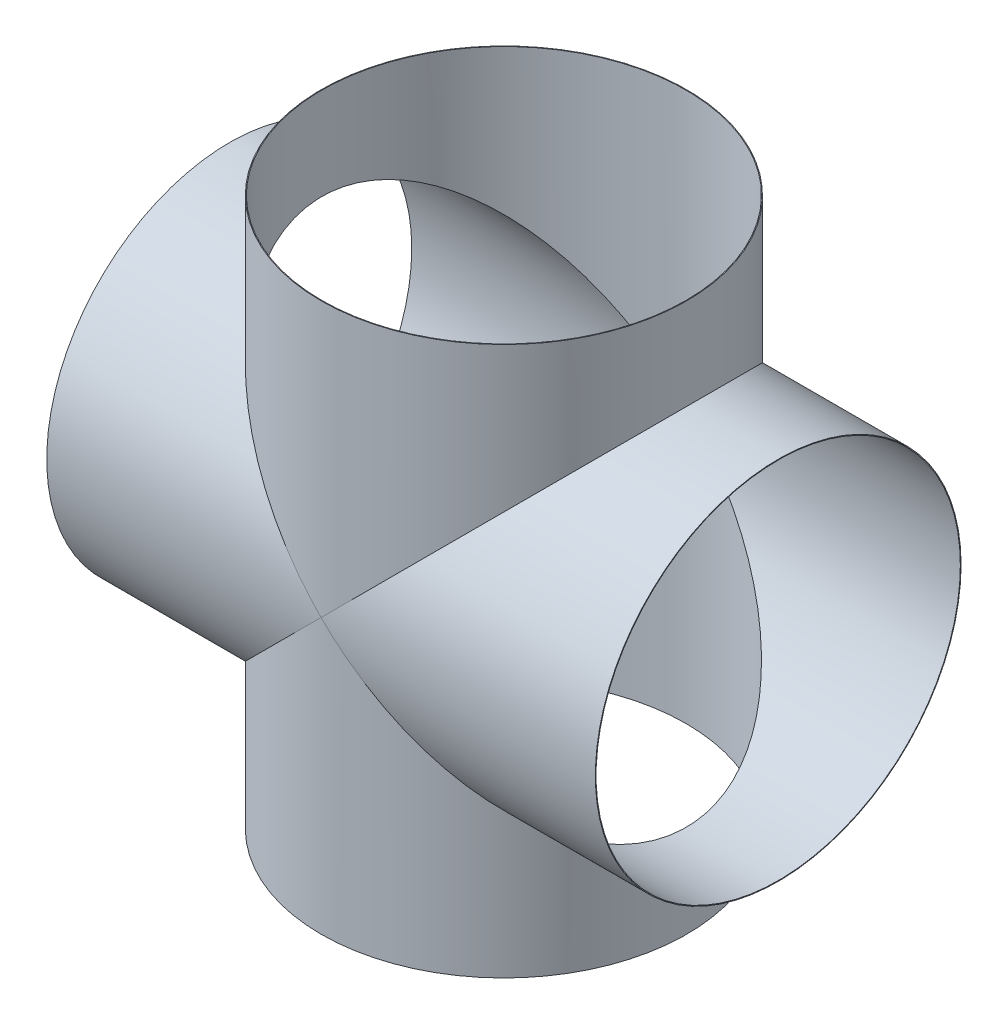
ISO-10303-21;
HEADER;
FILE_DESCRIPTION(('STEP AP214'),'2;1');
FILE_NAME('part.step','',(''),(''),'','','');
FILE_SCHEMA(('AUTOMOTIVE_DESIGN { 1 0 10303 214 1 1 1 1 }'));
ENDSEC;
DATA;
#1=APPLICATION_CONTEXT('core data for automotive mechanical design processes');
#2=APPLICATION_PROTOCOL_DEFINITION('international standard','automotive_design',2000,#1);
#3=PRODUCT_CONTEXT('',#1,'mechanical');
#4=PRODUCT('Part','Part','',(#3));
#5=PRODUCT_RELATED_PRODUCT_CATEGORY('part','',(#4));
#6=PRODUCT_DEFINITION_FORMATION('','',#4);
#7=PRODUCT_DEFINITION_CONTEXT('part definition',#1,'design');
#8=PRODUCT_DEFINITION('design','',#6,#7);
#9=PRODUCT_DEFINITION_SHAPE('','',#8);
#10=(LENGTH_UNIT() NAMED_UNIT(*) SI_UNIT(.MILLI.,.METRE.));
#11=(NAMED_UNIT(*) PLANE_ANGLE_UNIT() SI_UNIT($,.RADIAN.));
#12=(NAMED_UNIT(*) SI_UNIT($,.STERADIAN.) SOLID_ANGLE_UNIT());
#13=UNCERTAINTY_MEASURE_WITH_UNIT(LENGTH_MEASURE(1.E-05),#10,'distance_accuracy_value','');
#14=(GEOMETRIC_REPRESENTATION_CONTEXT(3) GLOBAL_UNCERTAINTY_ASSIGNED_CONTEXT((#13)) GLOBAL_UNIT_ASSIGNED_CONTEXT((#10,
#11,#12)) REPRESENTATION_CONTEXT('',''));
#15=CARTESIAN_POINT('',(0.,0.,0.));
#16=DIRECTION('',(0.,0.,1.));
#17=DIRECTION('',(1.,0.,0.));
#18=AXIS2_PLACEMENT_3D('',#15,#16,#17);
#19=CARTESIAN_POINT('',(750.,0.,0.));
#20=DIRECTION('',(-1.,0.,0.));
#21=DIRECTION('',(0.,0.,1.));
#22=AXIS2_PLACEMENT_3D('',#19,#20,#21);
#23=CYLINDRICAL_SURFACE('',#22,498.);
#24=CARTESIAN_POINT('',(750.,0.,0.));
#25=DIRECTION('',(1.,0.,0.));
#26=DIRECTION('',(0.,0.,-1.));
#27=AXIS2_PLACEMENT_3D('',#24,#25,#26);
#28=CIRCLE('',#27,498.);
#29=CARTESIAN_POINT('',(750.,0.,-498.));
#30=VERTEX_POINT('',#29);
#31=EDGE_CURVE('E112',#30,#30,#28,.T.);
#32=ORIENTED_EDGE('',*,*,#31,.T.);
#33=EDGE_LOOP('',(#32));
#34=FACE_BOUND('',#33,.T.);
#35=CARTESIAN_POINT('',(0.,0.,0.));
#36=DIRECTION('',(-0.707106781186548,0.707106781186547,0.));
#37=DIRECTION('',(0.707106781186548,0.707106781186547,0.));
#38=AXIS2_PLACEMENT_3D('',#35,#36,#37);
#39=ELLIPSE('',#38,704.278354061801,498.);
#40=CARTESIAN_POINT('',(-1.11022302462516E-13,-1.11022302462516E-13,498.));
#41=VERTEX_POINT('',#40);
#42=CARTESIAN_POINT('',(0.,0.,-498.));
#43=VERTEX_POINT('',#42);
#44=EDGE_CURVE('E85',#41,#43,#39,.T.);
#45=ORIENTED_EDGE('',*,*,#44,.T.);
#46=CARTESIAN_POINT('',(0.,0.,0.));
#47=DIRECTION('',(-0.707106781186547,-0.707106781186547,0.));
#48=DIRECTION('',(0.707106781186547,-0.707106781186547,0.));
#49=AXIS2_PLACEMENT_3D('',#46,#47,#48);
#50=ELLIPSE('',#49,704.278354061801,498.);
#51=EDGE_CURVE('E71',#41,#43,#50,.F.);
#52=ORIENTED_EDGE('',*,*,#51,.F.);
#53=EDGE_LOOP('',(#45,#52));
#54=FACE_BOUND('',#53,.T.);
#55=ADVANCED_FACE('F50',(#34,#54),#23,.F.);
#56=CARTESIAN_POINT('',(-750.,0.,0.));
#57=DIRECTION('',(1.,0.,0.));
#58=DIRECTION('',(0.,0.,-1.));
#59=AXIS2_PLACEMENT_3D('',#56,#57,#58);
#60=CIRCLE('',#59,498.);
#61=CARTESIAN_POINT('',(-750.,0.,-498.));
#62=VERTEX_POINT('',#61);
#63=EDGE_CURVE('E103',#62,#62,#60,.T.);
#64=ORIENTED_EDGE('',*,*,#63,.F.);
#65=EDGE_LOOP('',(#64));
#66=FACE_BOUND('',#65,.T.);
#67=CARTESIAN_POINT('',(0.,0.,0.));
#68=DIRECTION('',(0.707106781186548,0.707106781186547,0.));
#69=DIRECTION('',(-0.707106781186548,0.707106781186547,0.));
#70=AXIS2_PLACEMENT_3D('',#67,#68,#69);
#71=ELLIPSE('',#70,704.278354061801,498.);
#72=EDGE_CURVE('E90',#43,#41,#71,.T.);
#73=ORIENTED_EDGE('',*,*,#72,.T.);
#74=CARTESIAN_POINT('',(0.,0.,0.));
#75=DIRECTION('',(0.707106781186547,-0.707106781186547,0.));
#76=DIRECTION('',(-0.707106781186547,-0.707106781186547,0.));
#77=AXIS2_PLACEMENT_3D('',#74,#75,#76);
#78=ELLIPSE('',#77,704.278354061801,498.);
#79=EDGE_CURVE('E76',#43,#41,#78,.F.);
#80=ORIENTED_EDGE('',*,*,#79,.F.);
#81=EDGE_LOOP('',(#73,#80));
#82=FACE_BOUND('',#81,.T.);
#83=ADVANCED_FACE('F93',(#66,#82),#23,.F.);
#84=CARTESIAN_POINT('',(750.,0.,0.));
#85=DIRECTION('',(-1.,0.,0.));
#86=DIRECTION('',(0.,0.,1.));
#87=AXIS2_PLACEMENT_3D('',#84,#85,#86);
#88=CYLINDRICAL_SURFACE('',#87,500.);
#89=CARTESIAN_POINT('',(750.,0.,0.));
#90=DIRECTION('',(1.,0.,0.));
#91=DIRECTION('',(0.,0.,-1.));
#92=AXIS2_PLACEMENT_3D('',#89,#90,#91);
#93=CIRCLE('',#92,500.);
#94=CARTESIAN_POINT('',(750.,0.,-500.));
#95=VERTEX_POINT('',#94);
#96=EDGE_CURVE('E12',#95,#95,#93,.T.);
#97=ORIENTED_EDGE('',*,*,#96,.F.);
#98=EDGE_LOOP('',(#97));
#99=FACE_BOUND('',#98,.T.);
#100=CARTESIAN_POINT('',(0.,0.,0.));
#101=DIRECTION('',(-0.707106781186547,-0.707106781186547,0.));
#102=DIRECTION('',(0.707106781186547,-0.707106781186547,0.));
#103=AXIS2_PLACEMENT_3D('',#100,#101,#102);
#104=ELLIPSE('',#103,707.106781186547,500.);
#105=CARTESIAN_POINT('',(0.,0.,500.));
#106=VERTEX_POINT('',#105);
#107=CARTESIAN_POINT('',(0.,0.,-500.));
#108=VERTEX_POINT('',#107);
#109=EDGE_CURVE('E95',#106,#108,#104,.F.);
#110=ORIENTED_EDGE('',*,*,#109,.T.);
#111=CARTESIAN_POINT('',(0.,0.,0.));
#112=DIRECTION('',(-0.707106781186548,0.707106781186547,0.));
#113=DIRECTION('',(0.707106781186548,0.707106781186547,0.));
#114=AXIS2_PLACEMENT_3D('',#111,#112,#113);
#115=ELLIPSE('',#114,707.106781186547,500.);
#116=EDGE_CURVE('E104',#106,#108,#115,.T.);
#117=ORIENTED_EDGE('',*,*,#116,.F.);
#118=EDGE_LOOP('',(#110,#117));
#119=FACE_BOUND('',#118,.T.);
#120=ADVANCED_FACE('F52',(#99,#119),#88,.T.);
#121=CARTESIAN_POINT('',(-750.,0.,0.));
#122=DIRECTION('',(1.,0.,0.));
#123=DIRECTION('',(0.,0.,-1.));
#124=AXIS2_PLACEMENT_3D('',#121,#122,#123);
#125=CIRCLE('',#124,500.);
#126=CARTESIAN_POINT('',(-750.,0.,-500.));
#127=VERTEX_POINT('',#126);
#128=EDGE_CURVE('E54',#127,#127,#125,.T.);
#129=ORIENTED_EDGE('',*,*,#128,.T.);
#130=EDGE_LOOP('',(#129));
#131=FACE_BOUND('',#130,.T.);
#132=CARTESIAN_POINT('',(0.,0.,0.));
#133=DIRECTION('',(0.707106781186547,-0.707106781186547,0.));
#134=DIRECTION('',(-0.707106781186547,-0.707106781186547,0.));
#135=AXIS2_PLACEMENT_3D('',#132,#133,#134);
#136=ELLIPSE('',#135,707.106781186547,500.);
#137=EDGE_CURVE('E64',#108,#106,#136,.F.);
#138=ORIENTED_EDGE('',*,*,#137,.T.);
#139=CARTESIAN_POINT('',(0.,0.,0.));
#140=DIRECTION('',(0.707106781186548,0.707106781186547,0.));
#141=DIRECTION('',(-0.707106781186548,0.707106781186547,0.));
#142=AXIS2_PLACEMENT_3D('',#139,#140,#141);
#143=ELLIPSE('',#142,707.106781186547,500.);
#144=EDGE_CURVE('E101',#108,#106,#143,.T.);
#145=ORIENTED_EDGE('',*,*,#144,.F.);
#146=EDGE_LOOP('',(#138,#145));
#147=FACE_BOUND('',#146,.T.);
#148=ADVANCED_FACE('F126',(#131,#147),#88,.T.);
#149=CARTESIAN_POINT('',(750.,0.,0.));
#150=DIRECTION('',(1.,0.,0.));
#151=DIRECTION('',(0.,0.,-1.));
#152=AXIS2_PLACEMENT_3D('',#149,#150,#151);
#153=PLANE('',#152);
#154=ORIENTED_EDGE('',*,*,#96,.T.);
#155=EDGE_LOOP('',(#154));
#156=FACE_BOUND('',#155,.T.);
#157=ORIENTED_EDGE('',*,*,#31,.F.);
#158=EDGE_LOOP('',(#157));
#159=FACE_BOUND('',#158,.T.);
#160=ADVANCED_FACE('F133',(#156,#159),#153,.T.);
#161=CARTESIAN_POINT('',(-750.,0.,0.));
#162=DIRECTION('',(1.,0.,0.));
#163=DIRECTION('',(0.,0.,-1.));
#164=AXIS2_PLACEMENT_3D('',#161,#162,#163);
#165=PLANE('',#164);
#166=ORIENTED_EDGE('',*,*,#128,.F.);
#167=EDGE_LOOP('',(#166));
#168=FACE_BOUND('',#167,.T.);
#169=ORIENTED_EDGE('',*,*,#63,.T.);
#170=EDGE_LOOP('',(#169));
#171=FACE_BOUND('',#170,.T.);
#172=ADVANCED_FACE('F118',(#168,#171),#165,.F.);
#173=CARTESIAN_POINT('',(0.,-500.001,0.));
#174=DIRECTION('',(0.,1.,0.));
#175=DIRECTION('',(0.,0.,1.));
#176=AXIS2_PLACEMENT_3D('',#173,#174,#175);
#177=CYLINDRICAL_SURFACE('',#176,500.);
#178=CARTESIAN_POINT('',(0.,750.,0.));
#179=DIRECTION('',(0.,1.,0.));
#180=DIRECTION('',(0.,0.,1.));
#181=AXIS2_PLACEMENT_3D('',#178,#179,#180);
#182=CIRCLE('',#181,500.);
#183=CARTESIAN_POINT('',(0.,750.,500.));
#184=VERTEX_POINT('',#183);
#185=EDGE_CURVE('E107',#184,#184,#182,.T.);
#186=ORIENTED_EDGE('',*,*,#185,.F.);
#187=EDGE_LOOP('',(#186));
#188=FACE_BOUND('',#187,.T.);
#189=ORIENTED_EDGE('',*,*,#144,.T.);
#190=ORIENTED_EDGE('',*,*,#116,.T.);
#191=EDGE_LOOP('',(#189,#190));
#192=FACE_BOUND('',#191,.T.);
#193=ADVANCED_FACE('F131',(#188,#192),#177,.T.);
#194=CARTESIAN_POINT('',(0.,750.,0.));
#195=DIRECTION('',(0.,1.,0.));
#196=DIRECTION('',(0.,0.,1.));
#197=AXIS2_PLACEMENT_3D('',#194,#195,#196);
#198=PLANE('',#197);
#199=CARTESIAN_POINT('',(0.,750.,0.));
#200=DIRECTION('',(0.,1.,0.));
#201=DIRECTION('',(1.,0.,0.));
#202=AXIS2_PLACEMENT_3D('',#199,#200,#201);
#203=CIRCLE('',#202,498.);
#204=CARTESIAN_POINT('',(498.,750.,0.));
#205=VERTEX_POINT('',#204);
#206=EDGE_CURVE('E91',#205,#205,#203,.T.);
#207=ORIENTED_EDGE('',*,*,#206,.F.);
#208=EDGE_LOOP('',(#207));
#209=FACE_BOUND('',#208,.T.);
#210=ORIENTED_EDGE('',*,*,#185,.T.);
#211=EDGE_LOOP('',(#210));
#212=FACE_BOUND('',#211,.T.);
#213=ADVANCED_FACE('F141',(#209,#212),#198,.T.);
#214=CARTESIAN_POINT('',(0.,-500.001,0.));
#215=DIRECTION('',(0.,1.,0.));
#216=DIRECTION('',(0.,0.,1.));
#217=AXIS2_PLACEMENT_3D('',#214,#215,#216);
#218=CYLINDRICAL_SURFACE('',#217,498.);
#219=ORIENTED_EDGE('',*,*,#206,.T.);
#220=EDGE_LOOP('',(#219));
#221=FACE_BOUND('',#220,.T.);
#222=ORIENTED_EDGE('',*,*,#72,.F.);
#223=ORIENTED_EDGE('',*,*,#44,.F.);
#224=EDGE_LOOP('',(#222,#223));
#225=FACE_BOUND('',#224,.T.);
#226=ADVANCED_FACE('F89',(#221,#225),#218,.F.);
#227=CARTESIAN_POINT('',(0.,750.001,0.));
#228=DIRECTION('',(0.,-1.,0.));
#229=DIRECTION('',(0.,0.,-1.));
#230=AXIS2_PLACEMENT_3D('',#227,#228,#229);
#231=CYLINDRICAL_SURFACE('',#230,500.);
#232=CARTESIAN_POINT('',(0.,-750.,0.));
#233=DIRECTION('',(0.,1.,0.));
#234=DIRECTION('',(0.,0.,1.));
#235=AXIS2_PLACEMENT_3D('',#232,#233,#234);
#236=CIRCLE('',#235,500.);
#237=CARTESIAN_POINT('',(0.,-750.,500.));
#238=VERTEX_POINT('',#237);
#239=EDGE_CURVE('E98',#238,#238,#236,.T.);
#240=ORIENTED_EDGE('',*,*,#239,.T.);
#241=EDGE_LOOP('',(#240));
#242=FACE_BOUND('',#241,.T.);
#243=ORIENTED_EDGE('',*,*,#109,.F.);
#244=ORIENTED_EDGE('',*,*,#137,.F.);
#245=EDGE_LOOP('',(#243,#244));
#246=FACE_BOUND('',#245,.T.);
#247=ADVANCED_FACE('F195',(#242,#246),#231,.T.);
#248=CARTESIAN_POINT('',(0.,-750.,0.));
#249=DIRECTION('',(0.,1.,0.));
#250=DIRECTION('',(0.,0.,1.));
#251=AXIS2_PLACEMENT_3D('',#248,#249,#250);
#252=PLANE('',#251);
#253=ORIENTED_EDGE('',*,*,#239,.F.);
#254=EDGE_LOOP('',(#253));
#255=FACE_BOUND('',#254,.T.);
#256=CARTESIAN_POINT('',(0.,-750.,0.));
#257=DIRECTION('',(0.,1.,0.));
#258=DIRECTION('',(1.,0.,0.));
#259=AXIS2_PLACEMENT_3D('',#256,#257,#258);
#260=CIRCLE('',#259,498.);
#261=CARTESIAN_POINT('',(498.,-750.,0.));
#262=VERTEX_POINT('',#261);
#263=EDGE_CURVE('E86',#262,#262,#260,.T.);
#264=ORIENTED_EDGE('',*,*,#263,.T.);
#265=EDGE_LOOP('',(#264));
#266=FACE_BOUND('',#265,.T.);
#267=ADVANCED_FACE('F201',(#255,#266),#252,.F.);
#268=CARTESIAN_POINT('',(0.,750.001,0.));
#269=DIRECTION('',(0.,-1.,0.));
#270=DIRECTION('',(0.,0.,-1.));
#271=AXIS2_PLACEMENT_3D('',#268,#269,#270);
#272=CYLINDRICAL_SURFACE('',#271,498.);
#273=ORIENTED_EDGE('',*,*,#263,.F.);
#274=EDGE_LOOP('',(#273));
#275=FACE_BOUND('',#274,.T.);
#276=ORIENTED_EDGE('',*,*,#51,.T.);
#277=ORIENTED_EDGE('',*,*,#79,.T.);
#278=EDGE_LOOP('',(#276,#277));
#279=FACE_BOUND('',#278,.T.);
#280=ADVANCED_FACE('F77',(#275,#279),#272,.F.);
#281=CLOSED_SHELL('',(#55,#83,#120,#148,#160,#172,#193,#213,#226,#247,#267,#280));
#282=MANIFOLD_SOLID_BREP('B2',#281);
#283=ADVANCED_BREP_SHAPE_REPRESENTATION('',(#18,#282),#14);
#284=SHAPE_DEFINITION_REPRESENTATION(#9,#283);
ENDSEC;
END-ISO-10303-21;
